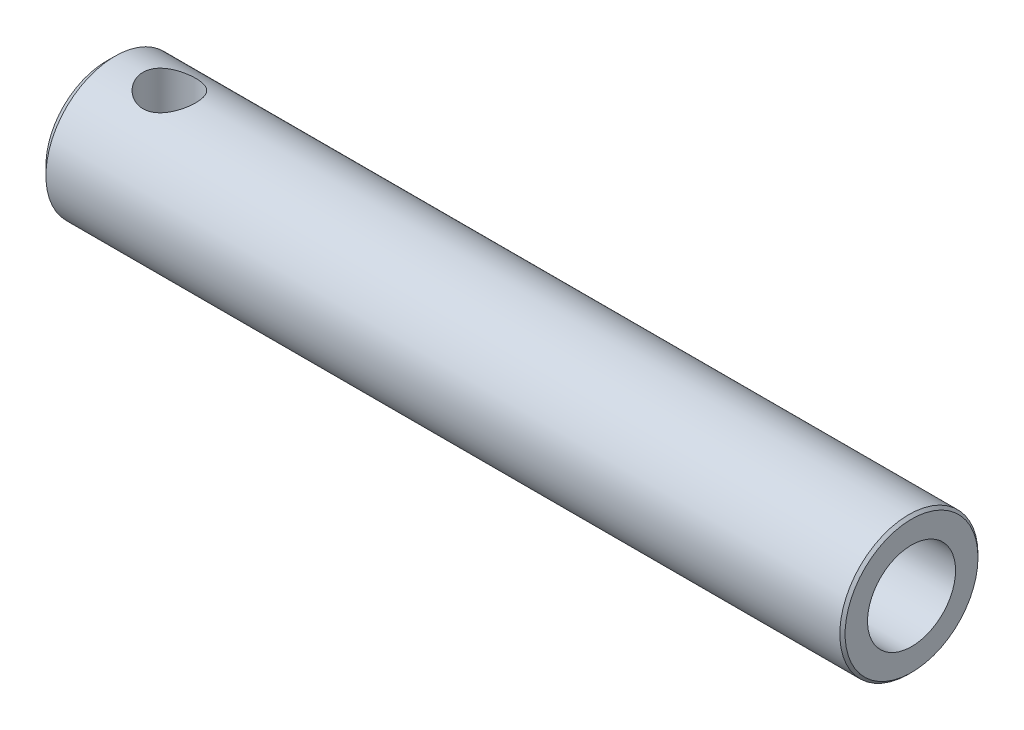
ISO-10303-21;
HEADER;
FILE_DESCRIPTION(('STEP AP214'),'2;1');
FILE_NAME('part.step','',(''),(''),'','','');
FILE_SCHEMA(('AUTOMOTIVE_DESIGN { 1 0 10303 214 1 1 1 1 }'));
ENDSEC;
DATA;
#1=APPLICATION_CONTEXT('core data for automotive mechanical design processes');
#2=APPLICATION_PROTOCOL_DEFINITION('international standard','automotive_design',2000,#1);
#3=PRODUCT_CONTEXT('',#1,'mechanical');
#4=PRODUCT('Part','Part','',(#3));
#5=PRODUCT_RELATED_PRODUCT_CATEGORY('part','',(#4));
#6=PRODUCT_DEFINITION_FORMATION('','',#4);
#7=PRODUCT_DEFINITION_CONTEXT('part definition',#1,'design');
#8=PRODUCT_DEFINITION('design','',#6,#7);
#9=PRODUCT_DEFINITION_SHAPE('','',#8);
#10=(LENGTH_UNIT() NAMED_UNIT(*) SI_UNIT(.MILLI.,.METRE.));
#11=(NAMED_UNIT(*) PLANE_ANGLE_UNIT() SI_UNIT($,.RADIAN.));
#12=(NAMED_UNIT(*) SI_UNIT($,.STERADIAN.) SOLID_ANGLE_UNIT());
#13=UNCERTAINTY_MEASURE_WITH_UNIT(LENGTH_MEASURE(1.E-05),#10,'distance_accuracy_value','');
#14=(GEOMETRIC_REPRESENTATION_CONTEXT(3) GLOBAL_UNCERTAINTY_ASSIGNED_CONTEXT((#13)) GLOBAL_UNIT_ASSIGNED_CONTEXT((#10,
#11,#12)) REPRESENTATION_CONTEXT('',''));
#15=CARTESIAN_POINT('',(0.,0.,0.));
#16=DIRECTION('',(0.,0.,1.));
#17=DIRECTION('',(1.,0.,0.));
#18=AXIS2_PLACEMENT_3D('',#15,#16,#17);
#19=CARTESIAN_POINT('',(-7.18,0.,0.));
#20=DIRECTION('',(-1.,0.,0.));
#21=DIRECTION('',(0.,0.,1.));
#22=AXIS2_PLACEMENT_3D('',#19,#20,#21);
#23=PLANE('',#22);
#24=CARTESIAN_POINT('',(-7.17999999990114,0.,0.));
#25=DIRECTION('',(1.,0.,0.));
#26=DIRECTION('',(0.,0.,-1.));
#27=AXIS2_PLACEMENT_3D('',#24,#25,#26);
#28=CIRCLE('',#27,6.8500000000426);
#29=CARTESIAN_POINT('',(-7.17999999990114,0.,-6.8500000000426));
#30=VERTEX_POINT('',#29);
#31=EDGE_CURVE('E34',#30,#30,#28,.T.);
#32=ORIENTED_EDGE('',*,*,#31,.F.);
#33=EDGE_LOOP('',(#32));
#34=FACE_BOUND('',#33,.T.);
#35=ADVANCED_FACE('F15',(#34),#23,.T.);
#36=CARTESIAN_POINT('',(0.,-10.,0.));
#37=DIRECTION('',(0.,1.,0.));
#38=DIRECTION('',(0.,0.,1.));
#39=AXIS2_PLACEMENT_3D('',#36,#37,#38);
#40=CYLINDRICAL_SURFACE('',#39,3.);
#41=CARTESIAN_POINT('',(0.,-7.25413675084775,-3.));
#42=CARTESIAN_POINT('',(-0.161507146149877,-7.25414752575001,-2.99998837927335));
#43=CARTESIAN_POINT('',(-0.323173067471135,-7.25960148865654,-2.98689044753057));
#44=CARTESIAN_POINT('',(-0.641776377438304,-7.28072612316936,-2.93500728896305));
#45=CARTESIAN_POINT('',(-0.798705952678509,-7.29641280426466,-2.89618180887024));
#46=CARTESIAN_POINT('',(-1.10289294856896,-7.33595126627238,-2.79450548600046));
#47=CARTESIAN_POINT('',(-1.25017910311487,-7.35977733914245,-2.73173021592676));
#48=CARTESIAN_POINT('',(-1.53213487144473,-7.41287547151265,-2.58416377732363));
#49=CARTESIAN_POINT('',(-1.66680435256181,-7.44214758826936,-2.49937237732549));
#50=CARTESIAN_POINT('',(-1.92674032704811,-7.50454194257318,-2.30546809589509));
#51=CARTESIAN_POINT('',(-2.05126463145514,-7.53778061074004,-2.19539736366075));
#52=CARTESIAN_POINT('',(-2.28061600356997,-7.60339470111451,-1.9560855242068));
#53=CARTESIAN_POINT('',(-2.38543785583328,-7.6357698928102,-1.82683935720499));
#54=CARTESIAN_POINT('',(-2.57600647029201,-7.69739412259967,-1.54719441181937));
#55=CARTESIAN_POINT('',(-2.66094361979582,-7.72649131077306,-1.39620744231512));
#56=CARTESIAN_POINT('',(-2.80390240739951,-7.77688064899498,-1.0807782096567));
#57=CARTESIAN_POINT('',(-2.86193377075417,-7.79817561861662,-0.916340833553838));
#58=CARTESIAN_POINT('',(-2.94682119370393,-7.82973630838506,-0.586465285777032));
#59=CARTESIAN_POINT('',(-2.97495295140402,-7.84045182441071,-0.421399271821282));
#60=CARTESIAN_POINT('',(-3.00333583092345,-7.8512637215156,-0.0885646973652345));
#61=CARTESIAN_POINT('',(-3.00359639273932,-7.85136369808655,0.0792029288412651));
#62=CARTESIAN_POINT('',(-2.97696016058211,-7.8412158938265,0.403513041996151));
#63=CARTESIAN_POINT('',(-2.95145726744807,-7.83149922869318,0.560189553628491));
#64=CARTESIAN_POINT('',(-2.8763702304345,-7.80351191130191,0.866844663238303));
#65=CARTESIAN_POINT('',(-2.82678431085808,-7.78524062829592,1.0168227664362));
#66=CARTESIAN_POINT('',(-2.70431806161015,-7.7416100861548,1.30845402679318));
#67=CARTESIAN_POINT('',(-2.6311049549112,-7.71615026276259,1.44995177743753));
#68=CARTESIAN_POINT('',(-2.46376767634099,-7.66070660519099,1.71900276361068));
#69=CARTESIAN_POINT('',(-2.36963750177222,-7.63072147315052,1.84655198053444));
#70=CARTESIAN_POINT('',(-2.15648443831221,-7.56716478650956,2.09226887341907));
#71=CARTESIAN_POINT('',(-2.03630133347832,-7.53348600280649,2.20940440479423));
#72=CARTESIAN_POINT('',(-1.77780904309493,-7.46776187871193,2.42228665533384));
#73=CARTESIAN_POINT('',(-1.63948963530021,-7.43571747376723,2.51802122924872));
#74=CARTESIAN_POINT('',(-1.3442066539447,-7.37618440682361,2.68751138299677));
#75=CARTESIAN_POINT('',(-1.18686953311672,-7.34882648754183,2.76067148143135));
#76=CARTESIAN_POINT('',(-0.942629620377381,-7.31467765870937,2.84938129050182));
#77=CARTESIAN_POINT('',(-0.85988254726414,-7.3044457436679,2.87543925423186));
#78=CARTESIAN_POINT('',(-0.692189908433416,-7.28661072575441,2.92034120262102));
#79=CARTESIAN_POINT('',(-0.607245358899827,-7.2790064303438,2.93918846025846));
#80=CARTESIAN_POINT('',(-0.43563976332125,-7.26670116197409,2.96948234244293));
#81=CARTESIAN_POINT('',(-0.348975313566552,-7.26200669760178,2.98091237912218));
#82=CARTESIAN_POINT('',(-0.174889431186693,-7.2557215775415,2.99617434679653));
#83=CARTESIAN_POINT('',(-0.0874680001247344,-7.25413091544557,3.0000062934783));
#84=CARTESIAN_POINT('',(0.161507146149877,-7.25414752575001,2.99998837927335));
#85=CARTESIAN_POINT('',(0.323173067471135,-7.25960148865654,2.98689044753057));
#86=CARTESIAN_POINT('',(0.641776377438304,-7.28072612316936,2.93500728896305));
#87=CARTESIAN_POINT('',(0.798705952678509,-7.29641280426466,2.89618180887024));
#88=CARTESIAN_POINT('',(1.10289294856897,-7.33595126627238,2.79450548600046));
#89=CARTESIAN_POINT('',(1.25017910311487,-7.35977733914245,2.73173021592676));
#90=CARTESIAN_POINT('',(1.53213487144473,-7.41287547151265,2.58416377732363));
#91=CARTESIAN_POINT('',(1.66680435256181,-7.44214758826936,2.49937237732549));
#92=CARTESIAN_POINT('',(1.92674032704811,-7.50454194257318,2.30546809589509));
#93=CARTESIAN_POINT('',(2.05126463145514,-7.53778061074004,2.19539736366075));
#94=CARTESIAN_POINT('',(2.28061600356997,-7.60339470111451,1.9560855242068));
#95=CARTESIAN_POINT('',(2.38543785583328,-7.6357698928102,1.82683935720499));
#96=CARTESIAN_POINT('',(2.57600647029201,-7.69739412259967,1.54719441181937));
#97=CARTESIAN_POINT('',(2.66094361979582,-7.72649131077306,1.39620744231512));
#98=CARTESIAN_POINT('',(2.80390240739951,-7.77688064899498,1.0807782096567));
#99=CARTESIAN_POINT('',(2.86193377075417,-7.79817561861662,0.916340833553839));
#100=CARTESIAN_POINT('',(2.94682119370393,-7.82973630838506,0.586465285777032));
#101=CARTESIAN_POINT('',(2.97495295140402,-7.84045182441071,0.421399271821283));
#102=CARTESIAN_POINT('',(3.00333583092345,-7.8512637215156,0.0885646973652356));
#103=CARTESIAN_POINT('',(3.00359639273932,-7.85136369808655,-0.0792029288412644));
#104=CARTESIAN_POINT('',(2.97696016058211,-7.8412158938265,-0.40351304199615));
#105=CARTESIAN_POINT('',(2.95145726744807,-7.83149922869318,-0.560189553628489));
#106=CARTESIAN_POINT('',(2.8763702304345,-7.80351191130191,-0.866844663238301));
#107=CARTESIAN_POINT('',(2.82678431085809,-7.78524062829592,-1.0168227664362));
#108=CARTESIAN_POINT('',(2.70431806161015,-7.7416100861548,-1.30845402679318));
#109=CARTESIAN_POINT('',(2.6311049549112,-7.71615026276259,-1.44995177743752));
#110=CARTESIAN_POINT('',(2.46376767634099,-7.66070660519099,-1.71900276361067));
#111=CARTESIAN_POINT('',(2.36963750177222,-7.63072147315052,-1.84655198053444));
#112=CARTESIAN_POINT('',(2.15648443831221,-7.56716478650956,-2.09226887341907));
#113=CARTESIAN_POINT('',(2.03630133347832,-7.53348600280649,-2.20940440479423));
#114=CARTESIAN_POINT('',(1.77780904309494,-7.46776187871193,-2.42228665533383));
#115=CARTESIAN_POINT('',(1.63948963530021,-7.43571747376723,-2.51802122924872));
#116=CARTESIAN_POINT('',(1.3442066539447,-7.37618440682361,-2.68751138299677));
#117=CARTESIAN_POINT('',(1.18686953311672,-7.34882648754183,-2.76067148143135));
#118=CARTESIAN_POINT('',(0.942629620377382,-7.31467765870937,-2.84938129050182));
#119=CARTESIAN_POINT('',(0.859882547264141,-7.3044457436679,-2.87543925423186));
#120=CARTESIAN_POINT('',(0.692189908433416,-7.28661072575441,-2.92034120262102));
#121=CARTESIAN_POINT('',(0.607245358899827,-7.2790064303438,-2.93918846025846));
#122=CARTESIAN_POINT('',(0.43563976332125,-7.26670116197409,-2.96948234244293));
#123=CARTESIAN_POINT('',(0.348975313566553,-7.26200669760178,-2.98091237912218));
#124=CARTESIAN_POINT('',(0.174889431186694,-7.25572157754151,-2.99617434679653));
#125=CARTESIAN_POINT('',(0.0874680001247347,-7.25413091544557,-3.0000062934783));
#126=CARTESIAN_POINT('',(0.,-7.25413675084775,-3.));
#127=B_SPLINE_CURVE_WITH_KNOTS('',3,(#41,#42,#43,#44,#45,#46,#47,#48,#49,#50,#51,#52,#53,#54,
#55,#56,#57,#58,#59,#60,#61,#62,#63,#64,#65,#66,#67,#68,#69,#70,#71,#72,#73,#74,#75,#76,#77,#78,
#79,#80,#81,#82,#83,#84,#85,#86,#87,#88,#89,#90,#91,#92,#93,#94,#95,#96,#97,#98,#99,#100,#101,
#102,#103,#104,#105,#106,#107,#108,#109,#110,#111,#112,#113,#114,#115,#116,#117,#118,#119,#120,
#121,#122,#123,#124,#125,#126),.UNSPECIFIED.,.T.,.F.,(4,2,2,2,2,2,2,2,2,2,2,2,2,2,2,2,2,2,2,2,2,
2,2,2,2,2,2,2,2,2,2,2,2,2,2,2,2,2,2,2,2,2,4),(0.,0.48419152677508,0.96914241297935,
1.4525755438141,1.9360137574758,2.44223408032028,2.94858821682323,3.47292451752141,
3.99707114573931,4.49782645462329,4.99841215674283,5.47329171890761,5.94820630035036,
6.43012527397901,6.91218272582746,7.42335993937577,7.93482651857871,8.45881504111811,
8.72057672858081,8.98221945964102,9.24444532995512,9.50667065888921,9.99086218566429,
10.4758130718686,10.9592462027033,11.442684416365,11.9489047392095,12.4552588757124,
12.9795951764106,13.5037418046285,14.0044971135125,14.505082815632,14.9799623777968,
15.4548769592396,15.9367959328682,16.4188533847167,16.930030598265,17.4414971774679,
17.9654857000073,18.22724738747,18.4888901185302,18.7511159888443,19.0133413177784),.UNSPECIFIED.);
#128=CARTESIAN_POINT('',(0.,-7.25413675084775,-3.));
#129=VERTEX_POINT('',#128);
#130=EDGE_CURVE('E37',#129,#129,#127,.T.);
#131=ORIENTED_EDGE('',*,*,#130,.F.);
#132=EDGE_LOOP('',(#131));
#133=FACE_BOUND('',#132,.T.);
#134=CARTESIAN_POINT('',(0.,7.25413675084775,3.));
#135=CARTESIAN_POINT('',(-0.161507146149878,7.25414752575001,2.99998837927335));
#136=CARTESIAN_POINT('',(-0.323173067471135,7.25960148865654,2.98689044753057));
#137=CARTESIAN_POINT('',(-0.641776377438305,7.28072612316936,2.93500728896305));
#138=CARTESIAN_POINT('',(-0.79870595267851,7.29641280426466,2.89618180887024));
#139=CARTESIAN_POINT('',(-1.10289294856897,7.33595126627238,2.79450548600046));
#140=CARTESIAN_POINT('',(-1.25017910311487,7.35977733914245,2.73173021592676));
#141=CARTESIAN_POINT('',(-1.53213487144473,7.41287547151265,2.58416377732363));
#142=CARTESIAN_POINT('',(-1.66680435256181,7.44214758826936,2.49937237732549));
#143=CARTESIAN_POINT('',(-1.92674032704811,7.50454194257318,2.30546809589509));
#144=CARTESIAN_POINT('',(-2.05126463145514,7.53778061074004,2.19539736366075));
#145=CARTESIAN_POINT('',(-2.28061600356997,7.60339470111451,1.95608552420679));
#146=CARTESIAN_POINT('',(-2.38543785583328,7.6357698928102,1.82683935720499));
#147=CARTESIAN_POINT('',(-2.57600647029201,7.69739412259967,1.54719441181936));
#148=CARTESIAN_POINT('',(-2.66094361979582,7.72649131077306,1.39620744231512));
#149=CARTESIAN_POINT('',(-2.80390240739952,7.77688064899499,1.0807782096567));
#150=CARTESIAN_POINT('',(-2.86193377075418,7.79817561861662,0.916340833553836));
#151=CARTESIAN_POINT('',(-2.94682119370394,7.82973630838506,0.58646528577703));
#152=CARTESIAN_POINT('',(-2.97495295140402,7.84045182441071,0.42139927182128));
#153=CARTESIAN_POINT('',(-3.00333583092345,7.8512637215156,0.0885646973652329));
#154=CARTESIAN_POINT('',(-3.00359639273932,7.85136369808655,-0.0792029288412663));
#155=CARTESIAN_POINT('',(-2.97696016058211,7.8412158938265,-0.403513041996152));
#156=CARTESIAN_POINT('',(-2.95145726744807,7.83149922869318,-0.560189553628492));
#157=CARTESIAN_POINT('',(-2.8763702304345,7.80351191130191,-0.866844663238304));
#158=CARTESIAN_POINT('',(-2.82678431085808,7.78524062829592,-1.0168227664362));
#159=CARTESIAN_POINT('',(-2.70431806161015,7.7416100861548,-1.30845402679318));
#160=CARTESIAN_POINT('',(-2.6311049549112,7.71615026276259,-1.44995177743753));
#161=CARTESIAN_POINT('',(-2.46376767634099,7.66070660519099,-1.71900276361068));
#162=CARTESIAN_POINT('',(-2.36963750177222,7.63072147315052,-1.84655198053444));
#163=CARTESIAN_POINT('',(-2.15648443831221,7.56716478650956,-2.09226887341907));
#164=CARTESIAN_POINT('',(-2.03630133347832,7.53348600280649,-2.20940440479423));
#165=CARTESIAN_POINT('',(-1.77780904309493,7.46776187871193,-2.42228665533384));
#166=CARTESIAN_POINT('',(-1.63948963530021,7.43571747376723,-2.51802122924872));
#167=CARTESIAN_POINT('',(-1.3442066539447,7.37618440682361,-2.68751138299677));
#168=CARTESIAN_POINT('',(-1.18686953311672,7.34882648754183,-2.76067148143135));
#169=CARTESIAN_POINT('',(-0.942629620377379,7.31467765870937,-2.84938129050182));
#170=CARTESIAN_POINT('',(-0.859882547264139,7.3044457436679,-2.87543925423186));
#171=CARTESIAN_POINT('',(-0.692189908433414,7.28661072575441,-2.92034120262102));
#172=CARTESIAN_POINT('',(-0.607245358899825,7.2790064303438,-2.93918846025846));
#173=CARTESIAN_POINT('',(-0.435639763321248,7.26670116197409,-2.96948234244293));
#174=CARTESIAN_POINT('',(-0.348975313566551,7.26200669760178,-2.98091237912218));
#175=CARTESIAN_POINT('',(-0.174889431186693,7.25572157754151,-2.99617434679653));
#176=CARTESIAN_POINT('',(-0.087468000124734,7.25413091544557,-3.0000062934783));
#177=CARTESIAN_POINT('',(0.161507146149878,7.25414752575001,-2.99998837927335));
#178=CARTESIAN_POINT('',(0.323173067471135,7.25960148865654,-2.98689044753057));
#179=CARTESIAN_POINT('',(0.641776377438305,7.28072612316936,-2.93500728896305));
#180=CARTESIAN_POINT('',(0.79870595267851,7.29641280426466,-2.89618180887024));
#181=CARTESIAN_POINT('',(1.10289294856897,7.33595126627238,-2.79450548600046));
#182=CARTESIAN_POINT('',(1.25017910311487,7.35977733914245,-2.73173021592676));
#183=CARTESIAN_POINT('',(1.53213487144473,7.41287547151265,-2.58416377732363));
#184=CARTESIAN_POINT('',(1.66680435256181,7.44214758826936,-2.49937237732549));
#185=CARTESIAN_POINT('',(1.92674032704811,7.50454194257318,-2.30546809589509));
#186=CARTESIAN_POINT('',(2.05126463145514,7.53778061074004,-2.19539736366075));
#187=CARTESIAN_POINT('',(2.28061600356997,7.60339470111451,-1.95608552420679));
#188=CARTESIAN_POINT('',(2.38543785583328,7.6357698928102,-1.82683935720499));
#189=CARTESIAN_POINT('',(2.57600647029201,7.69739412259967,-1.54719441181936));
#190=CARTESIAN_POINT('',(2.66094361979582,7.72649131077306,-1.39620744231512));
#191=CARTESIAN_POINT('',(2.80390240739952,7.77688064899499,-1.0807782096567));
#192=CARTESIAN_POINT('',(2.86193377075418,7.79817561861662,-0.916340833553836));
#193=CARTESIAN_POINT('',(2.94682119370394,7.82973630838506,-0.58646528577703));
#194=CARTESIAN_POINT('',(2.97495295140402,7.84045182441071,-0.42139927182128));
#195=CARTESIAN_POINT('',(3.00333583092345,7.8512637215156,-0.0885646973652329));
#196=CARTESIAN_POINT('',(3.00359639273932,7.85136369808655,0.0792029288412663));
#197=CARTESIAN_POINT('',(2.97696016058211,7.8412158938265,0.403513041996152));
#198=CARTESIAN_POINT('',(2.95145726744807,7.83149922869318,0.560189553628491));
#199=CARTESIAN_POINT('',(2.8763702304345,7.80351191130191,0.866844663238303));
#200=CARTESIAN_POINT('',(2.82678431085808,7.78524062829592,1.0168227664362));
#201=CARTESIAN_POINT('',(2.70431806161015,7.7416100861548,1.30845402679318));
#202=CARTESIAN_POINT('',(2.63110495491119,7.71615026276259,1.44995177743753));
#203=CARTESIAN_POINT('',(2.46376767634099,7.66070660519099,1.71900276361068));
#204=CARTESIAN_POINT('',(2.36963750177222,7.63072147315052,1.84655198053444));
#205=CARTESIAN_POINT('',(2.15648443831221,7.56716478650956,2.09226887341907));
#206=CARTESIAN_POINT('',(2.03630133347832,7.53348600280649,2.20940440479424));
#207=CARTESIAN_POINT('',(1.77780904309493,7.46776187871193,2.42228665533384));
#208=CARTESIAN_POINT('',(1.63948963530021,7.43571747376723,2.51802122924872));
#209=CARTESIAN_POINT('',(1.3442066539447,7.37618440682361,2.68751138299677));
#210=CARTESIAN_POINT('',(1.18686953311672,7.34882648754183,2.76067148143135));
#211=CARTESIAN_POINT('',(0.942629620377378,7.31467765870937,2.84938129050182));
#212=CARTESIAN_POINT('',(0.859882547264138,7.3044457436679,2.87543925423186));
#213=CARTESIAN_POINT('',(0.692189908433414,7.28661072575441,2.92034120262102));
#214=CARTESIAN_POINT('',(0.607245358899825,7.2790064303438,2.93918846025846));
#215=CARTESIAN_POINT('',(0.435639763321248,7.26670116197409,2.96948234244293));
#216=CARTESIAN_POINT('',(0.348975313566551,7.26200669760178,2.98091237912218));
#217=CARTESIAN_POINT('',(0.174889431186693,7.25572157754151,2.99617434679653));
#218=CARTESIAN_POINT('',(0.0874680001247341,7.25413091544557,3.0000062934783));
#219=CARTESIAN_POINT('',(0.,7.25413675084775,3.));
#220=B_SPLINE_CURVE_WITH_KNOTS('',3,(#134,#135,#136,#137,#138,#139,#140,#141,#142,#143,#144,
#145,#146,#147,#148,#149,#150,#151,#152,#153,#154,#155,#156,#157,#158,#159,#160,#161,#162,#163,
#164,#165,#166,#167,#168,#169,#170,#171,#172,#173,#174,#175,#176,#177,#178,#179,#180,#181,#182,
#183,#184,#185,#186,#187,#188,#189,#190,#191,#192,#193,#194,#195,#196,#197,#198,#199,#200,#201,
#202,#203,#204,#205,#206,#207,#208,#209,#210,#211,#212,#213,#214,#215,#216,#217,#218,#219),
.UNSPECIFIED.,.T.,.F.,(4,2,2,2,2,2,2,2,2,2,2,2,2,2,2,2,2,2,2,2,2,2,2,2,2,2,2,2,2,2,2,2,2,2,2,2,
2,2,2,2,2,2,4),(0.,0.48419152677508,0.96914241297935,1.4525755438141,1.93601375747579,
2.44223408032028,2.94858821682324,3.47292451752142,3.99707114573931,4.49782645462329,
4.99841215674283,5.47329171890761,5.94820630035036,6.43012527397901,6.91218272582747,
7.42335993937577,7.93482651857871,8.45881504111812,8.72057672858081,8.98221945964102,
9.24444532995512,9.50667065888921,9.99086218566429,10.4758130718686,10.9592462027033,
11.442684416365,11.9489047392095,12.4552588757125,12.9795951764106,13.5037418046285,
14.0044971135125,14.505082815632,14.9799623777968,15.4548769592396,15.9367959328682,
16.4188533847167,16.930030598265,17.4414971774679,17.9654857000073,18.22724738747,
18.4888901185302,18.7511159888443,19.0133413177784),.UNSPECIFIED.);
#221=CARTESIAN_POINT('',(0.,7.25413675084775,3.));
#222=VERTEX_POINT('',#221);
#223=EDGE_CURVE('E31',#222,#222,#220,.T.);
#224=ORIENTED_EDGE('',*,*,#223,.F.);
#225=EDGE_LOOP('',(#224));
#226=FACE_BOUND('',#225,.T.);
#227=ADVANCED_FACE('F49',(#133,#226),#40,.F.);
#228=CARTESIAN_POINT('',(-6.18,0.,0.));
#229=DIRECTION('',(1.,0.,0.));
#230=DIRECTION('',(0.,0.,-1.));
#231=AXIS2_PLACEMENT_3D('',#228,#229,#230);
#232=CONICAL_SURFACE('',#231,7.85000000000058,0.785398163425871);
#233=CARTESIAN_POINT('',(-6.18,0.,0.));
#234=DIRECTION('',(1.,0.,0.));
#235=DIRECTION('',(0.,0.,-1.));
#236=AXIS2_PLACEMENT_3D('',#233,#234,#235);
#237=CIRCLE('',#236,7.85);
#238=CARTESIAN_POINT('',(-6.18,0.,-7.85));
#239=VERTEX_POINT('',#238);
#240=EDGE_CURVE('E27',#239,#239,#237,.T.);
#241=ORIENTED_EDGE('',*,*,#240,.F.);
#242=EDGE_LOOP('',(#241));
#243=FACE_BOUND('',#242,.T.);
#244=ORIENTED_EDGE('',*,*,#31,.T.);
#245=EDGE_LOOP('',(#244));
#246=FACE_BOUND('',#245,.T.);
#247=ADVANCED_FACE('F58',(#243,#246),#232,.T.);
#248=CARTESIAN_POINT('',(-7.18,0.,0.));
#249=DIRECTION('',(1.,0.,0.));
#250=DIRECTION('',(0.,0.,-1.));
#251=AXIS2_PLACEMENT_3D('',#248,#249,#250);
#252=CYLINDRICAL_SURFACE('',#251,7.85);
#253=CARTESIAN_POINT('',(84.02,0.,0.));
#254=DIRECTION('',(1.,0.,0.));
#255=DIRECTION('',(0.,0.,-1.));
#256=AXIS2_PLACEMENT_3D('',#253,#254,#255);
#257=CIRCLE('',#256,7.85);
#258=CARTESIAN_POINT('',(84.02,0.,-7.85));
#259=VERTEX_POINT('',#258);
#260=EDGE_CURVE('E10',#259,#259,#257,.F.);
#261=ORIENTED_EDGE('',*,*,#260,.T.);
#262=EDGE_LOOP('',(#261));
#263=FACE_BOUND('',#262,.T.);
#264=ORIENTED_EDGE('',*,*,#240,.T.);
#265=EDGE_LOOP('',(#264));
#266=FACE_BOUND('',#265,.T.);
#267=ORIENTED_EDGE('',*,*,#223,.T.);
#268=EDGE_LOOP('',(#267));
#269=FACE_BOUND('',#268,.T.);
#270=ORIENTED_EDGE('',*,*,#130,.T.);
#271=EDGE_LOOP('',(#270));
#272=FACE_BOUND('',#271,.T.);
#273=ADVANCED_FACE('F53',(#263,#266,#269,#272),#252,.T.);
#274=CARTESIAN_POINT('',(84.32,0.,0.));
#275=DIRECTION('',(1.,0.,0.));
#276=DIRECTION('',(0.,0.,-1.));
#277=AXIS2_PLACEMENT_3D('',#274,#275,#276);
#278=PLANE('',#277);
#279=CARTESIAN_POINT('',(84.32,0.,0.));
#280=DIRECTION('',(1.,0.,0.));
#281=DIRECTION('',(0.,0.,-1.));
#282=AXIS2_PLACEMENT_3D('',#279,#280,#281);
#283=CIRCLE('',#282,7.55);
#284=CARTESIAN_POINT('',(84.32,0.,-7.55));
#285=VERTEX_POINT('',#284);
#286=EDGE_CURVE('E23',#285,#285,#283,.T.);
#287=ORIENTED_EDGE('',*,*,#286,.T.);
#288=EDGE_LOOP('',(#287));
#289=FACE_BOUND('',#288,.T.);
#290=CARTESIAN_POINT('',(84.32,0.,0.));
#291=DIRECTION('',(1.,0.,0.));
#292=DIRECTION('',(0.,0.,-1.));
#293=AXIS2_PLACEMENT_3D('',#290,#291,#292);
#294=CIRCLE('',#293,5.);
#295=CARTESIAN_POINT('',(84.32,0.,-5.));
#296=VERTEX_POINT('',#295);
#297=EDGE_CURVE('E38',#296,#296,#294,.T.);
#298=ORIENTED_EDGE('',*,*,#297,.F.);
#299=EDGE_LOOP('',(#298));
#300=FACE_BOUND('',#299,.T.);
#301=ADVANCED_FACE('F57',(#289,#300),#278,.T.);
#302=CARTESIAN_POINT('',(99.22,0.,0.));
#303=DIRECTION('',(-1.,0.,0.));
#304=DIRECTION('',(0.,0.,1.));
#305=AXIS2_PLACEMENT_3D('',#302,#303,#304);
#306=CYLINDRICAL_SURFACE('',#305,5.);
#307=ORIENTED_EDGE('',*,*,#297,.T.);
#308=EDGE_LOOP('',(#307));
#309=FACE_BOUND('',#308,.T.);
#310=CARTESIAN_POINT('',(52.32,0.,0.));
#311=DIRECTION('',(1.,0.,0.));
#312=DIRECTION('',(0.,0.,-1.));
#313=AXIS2_PLACEMENT_3D('',#310,#311,#312);
#314=CIRCLE('',#313,5.);
#315=CARTESIAN_POINT('',(52.32,0.,-5.));
#316=VERTEX_POINT('',#315);
#317=EDGE_CURVE('E87',#316,#316,#314,.T.);
#318=ORIENTED_EDGE('',*,*,#317,.F.);
#319=EDGE_LOOP('',(#318));
#320=FACE_BOUND('',#319,.T.);
#321=ADVANCED_FACE('F78',(#309,#320),#306,.F.);
#322=CARTESIAN_POINT('',(84.32,0.,0.));
#323=DIRECTION('',(-1.,0.,0.));
#324=DIRECTION('',(0.,0.,1.));
#325=AXIS2_PLACEMENT_3D('',#322,#323,#324);
#326=CONICAL_SURFACE('',#325,7.55,0.785398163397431);
#327=ORIENTED_EDGE('',*,*,#260,.F.);
#328=EDGE_LOOP('',(#327));
#329=FACE_BOUND('',#328,.T.);
#330=ORIENTED_EDGE('',*,*,#286,.F.);
#331=EDGE_LOOP('',(#330));
#332=FACE_BOUND('',#331,.T.);
#333=ADVANCED_FACE('F18',(#329,#332),#326,.T.);
#334=CARTESIAN_POINT('',(52.32,0.,0.));
#335=DIRECTION('',(1.,0.,0.));
#336=DIRECTION('',(0.,0.,-1.));
#337=AXIS2_PLACEMENT_3D('',#334,#335,#336);
#338=PLANE('',#337);
#339=ORIENTED_EDGE('',*,*,#317,.T.);
#340=EDGE_LOOP('',(#339));
#341=FACE_BOUND('',#340,.T.);
#342=ADVANCED_FACE('F93',(#341),#338,.T.);
#343=CLOSED_SHELL('',(#35,#227,#247,#273,#301,#321,#333,#342));
#344=MANIFOLD_SOLID_BREP('B1',#343);
#345=ADVANCED_BREP_SHAPE_REPRESENTATION('',(#18,#344),#14);
#346=SHAPE_DEFINITION_REPRESENTATION(#9,#345);
ENDSEC;
END-ISO-10303-21;
